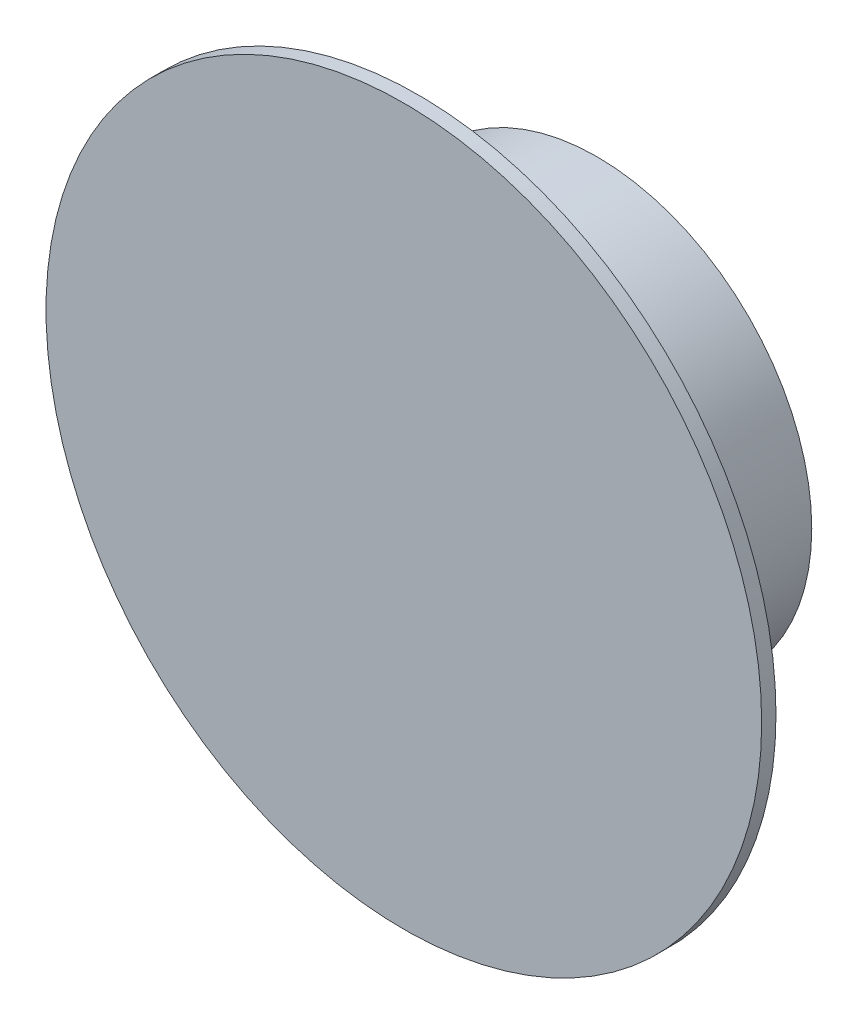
from build123d import *

# Parameters (mm, degrees)
CROQUIS1_R              = 30
SALIENTE_EXTRUIR1_DEPTH = 25
REDONDEO1_R             = 2
VACIADO1_T              = -1.5
CROQUIS2_R              = 50
SALIENTE_EXTRUIR2_DEPTH = 2


with BuildPart() as part:
    # Croquis1 → Saliente-Extruir1 (new body)
    with BuildSketch(Plane.XY):
        Circle(CROQUIS1_R)
    extrude(amount=SALIENTE_EXTRUIR1_DEPTH)

    # Redondeo1
    redondeo1_edges = [part.edges().sort_by_distance(p)[0] for p in [
        (-30, 0, 25),
    ]]
    fillet(redondeo1_edges, radius=REDONDEO1_R)

    # Vaciado1
    vaciado1_openings = [part.faces().sort_by_distance(p)[0] for p in [
        (0, 0, 0),
    ]]
    offset(amount=VACIADO1_T, openings=vaciado1_openings, kind=Kind.INTERSECTION)


with BuildPart() as body_2:
    # Croquis2 → Saliente-Extruir2 (new body)
    with BuildSketch(Plane.XY.offset(25)):
        Circle(CROQUIS2_R)
    extrude(amount=SALIENTE_EXTRUIR2_DEPTH)


solid = Compound([part.part, body_2.part])
